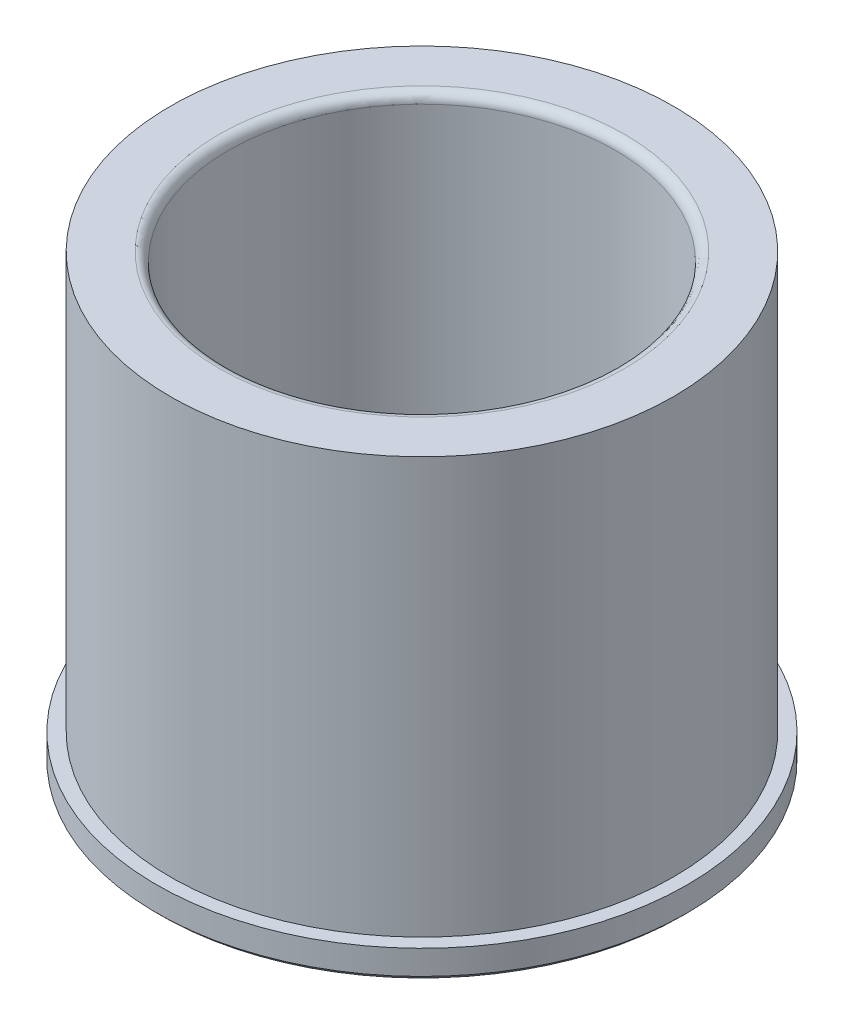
ISO-10303-21;
HEADER;
FILE_DESCRIPTION(('STEP AP214'),'2;1');
FILE_NAME('part.step','',(''),(''),'','','');
FILE_SCHEMA(('AUTOMOTIVE_DESIGN { 1 0 10303 214 1 1 1 1 }'));
ENDSEC;
DATA;
#1=APPLICATION_CONTEXT('core data for automotive mechanical design processes');
#2=APPLICATION_PROTOCOL_DEFINITION('international standard','automotive_design',2000,#1);
#3=PRODUCT_CONTEXT('',#1,'mechanical');
#4=PRODUCT('Part','Part','',(#3));
#5=PRODUCT_RELATED_PRODUCT_CATEGORY('part','',(#4));
#6=PRODUCT_DEFINITION_FORMATION('','',#4);
#7=PRODUCT_DEFINITION_CONTEXT('part definition',#1,'design');
#8=PRODUCT_DEFINITION('design','',#6,#7);
#9=PRODUCT_DEFINITION_SHAPE('','',#8);
#10=(LENGTH_UNIT() NAMED_UNIT(*) SI_UNIT(.MILLI.,.METRE.));
#11=(NAMED_UNIT(*) PLANE_ANGLE_UNIT() SI_UNIT($,.RADIAN.));
#12=(NAMED_UNIT(*) SI_UNIT($,.STERADIAN.) SOLID_ANGLE_UNIT());
#13=UNCERTAINTY_MEASURE_WITH_UNIT(LENGTH_MEASURE(1.E-05),#10,'distance_accuracy_value','');
#14=(GEOMETRIC_REPRESENTATION_CONTEXT(3) GLOBAL_UNCERTAINTY_ASSIGNED_CONTEXT((#13)) GLOBAL_UNIT_ASSIGNED_CONTEXT((#10,
#11,#12)) REPRESENTATION_CONTEXT('',''));
#15=CARTESIAN_POINT('',(0.,0.,0.));
#16=DIRECTION('',(0.,0.,1.));
#17=DIRECTION('',(1.,0.,0.));
#18=AXIS2_PLACEMENT_3D('',#15,#16,#17);
#19=CARTESIAN_POINT('',(3.49148336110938E-12,-1000.,0.));
#20=DIRECTION('',(0.,-1.,0.));
#21=DIRECTION('',(1.,0.,0.));
#22=AXIS2_PLACEMENT_3D('',#19,#20,#21);
#23=CYLINDRICAL_SURFACE('',#22,41.2813499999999);
#24=CARTESIAN_POINT('',(0.,4.76250000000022,0.));
#25=DIRECTION('',(0.,-1.,0.));
#26=DIRECTION('',(1.,0.,0.));
#27=AXIS2_PLACEMENT_3D('',#24,#25,#26);
#28=CIRCLE('',#27,41.28135);
#29=CARTESIAN_POINT('',(41.2813499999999,4.76250000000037,0.));
#30=VERTEX_POINT('',#29);
#31=EDGE_CURVE('E60',#30,#30,#28,.T.);
#32=ORIENTED_EDGE('',*,*,#31,.F.);
#33=EDGE_LOOP('',(#32));
#34=FACE_BOUND('',#33,.T.);
#35=CARTESIAN_POINT('',(-2.54965572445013E-13,73.0250000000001,0.));
#36=DIRECTION('',(0.,-1.,0.));
#37=DIRECTION('',(1.,0.,0.));
#38=AXIS2_PLACEMENT_3D('',#35,#36,#37);
#39=CIRCLE('',#38,41.2813499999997);
#40=CARTESIAN_POINT('',(41.2813499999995,73.0250000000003,0.));
#41=VERTEX_POINT('',#40);
#42=EDGE_CURVE('E39',#41,#41,#39,.T.);
#43=ORIENTED_EDGE('',*,*,#42,.T.);
#44=EDGE_LOOP('',(#43));
#45=FACE_BOUND('',#44,.T.);
#46=ADVANCED_FACE('F28',(#34,#45),#23,.T.);
#47=CARTESIAN_POINT('',(-41.28135,73.025,0.));
#48=DIRECTION('',(0.,-1.,0.));
#49=DIRECTION('',(1.,0.,0.));
#50=AXIS2_PLACEMENT_3D('',#47,#48,#49);
#51=PLANE('',#50);
#52=CARTESIAN_POINT('',(-2.54965572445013E-13,73.0250000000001,0.));
#53=DIRECTION('',(0.,-1.,0.));
#54=DIRECTION('',(1.,0.,0.));
#55=AXIS2_PLACEMENT_3D('',#52,#53,#54);
#56=CIRCLE('',#55,33.2803499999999);
#57=CARTESIAN_POINT('',(33.2803499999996,73.0250000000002,0.));
#58=VERTEX_POINT('',#57);
#59=EDGE_CURVE('E35',#58,#58,#56,.T.);
#60=ORIENTED_EDGE('',*,*,#59,.T.);
#61=EDGE_LOOP('',(#60));
#62=FACE_BOUND('',#61,.T.);
#63=ORIENTED_EDGE('',*,*,#42,.F.);
#64=EDGE_LOOP('',(#63));
#65=FACE_BOUND('',#64,.T.);
#66=ADVANCED_FACE('F68',(#62,#65),#51,.F.);
#67=CARTESIAN_POINT('',(3.49148336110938E-12,-1000.,0.));
#68=DIRECTION('',(0.,-1.,0.));
#69=DIRECTION('',(1.,0.,0.));
#70=AXIS2_PLACEMENT_3D('',#67,#68,#69);
#71=CYLINDRICAL_SURFACE('',#70,31.7563499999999);
#72=CARTESIAN_POINT('',(-2.49644551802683E-13,71.5010000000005,0.));
#73=DIRECTION('',(0.,-1.,0.));
#74=DIRECTION('',(1.,0.,0.));
#75=AXIS2_PLACEMENT_3D('',#72,#73,#74);
#76=CIRCLE('',#75,31.7563499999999);
#77=CARTESIAN_POINT('',(31.7563499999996,71.5010000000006,0.));
#78=VERTEX_POINT('',#77);
#79=EDGE_CURVE('E10',#78,#78,#76,.F.);
#80=ORIENTED_EDGE('',*,*,#79,.T.);
#81=EDGE_LOOP('',(#80));
#82=FACE_BOUND('',#81,.T.);
#83=CARTESIAN_POINT('',(0.,0.761999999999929,0.));
#84=DIRECTION('',(0.,-1.,0.));
#85=DIRECTION('',(1.,0.,0.));
#86=AXIS2_PLACEMENT_3D('',#83,#84,#85);
#87=CIRCLE('',#86,31.75635);
#88=CARTESIAN_POINT('',(31.75635,0.76200000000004,0.));
#89=VERTEX_POINT('',#88);
#90=EDGE_CURVE('E43',#89,#89,#87,.T.);
#91=ORIENTED_EDGE('',*,*,#90,.T.);
#92=EDGE_LOOP('',(#91));
#93=FACE_BOUND('',#92,.T.);
#94=ADVANCED_FACE('F72',(#82,#93),#71,.F.);
#95=CARTESIAN_POINT('',(0.,2.22044604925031E-13,0.));
#96=DIRECTION('',(0.,-1.,0.));
#97=DIRECTION('',(1.,0.,0.));
#98=AXIS2_PLACEMENT_3D('',#95,#96,#97);
#99=CONICAL_SURFACE('',#98,32.51835,0.78539816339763);
#100=ORIENTED_EDGE('',*,*,#90,.F.);
#101=EDGE_LOOP('',(#100));
#102=FACE_BOUND('',#101,.T.);
#103=CARTESIAN_POINT('',(0.,2.22044604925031E-13,0.));
#104=DIRECTION('',(0.,-1.,0.));
#105=DIRECTION('',(1.,0.,0.));
#106=AXIS2_PLACEMENT_3D('',#103,#104,#105);
#107=CIRCLE('',#106,32.51835);
#108=CARTESIAN_POINT('',(32.51835,3.35581882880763E-13,0.));
#109=VERTEX_POINT('',#108);
#110=EDGE_CURVE('E48',#109,#109,#107,.T.);
#111=ORIENTED_EDGE('',*,*,#110,.T.);
#112=EDGE_LOOP('',(#111));
#113=FACE_BOUND('',#112,.T.);
#114=ADVANCED_FACE('F77',(#102,#113),#99,.F.);
#115=CARTESIAN_POINT('',(-32.51835,0.,0.));
#116=DIRECTION('',(0.,1.,0.));
#117=DIRECTION('',(-1.,0.,0.));
#118=AXIS2_PLACEMENT_3D('',#115,#116,#117);
#119=PLANE('',#118);
#120=ORIENTED_EDGE('',*,*,#110,.F.);
#121=EDGE_LOOP('',(#120));
#122=FACE_BOUND('',#121,.T.);
#123=CARTESIAN_POINT('',(0.,2.22044604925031E-13,0.));
#124=DIRECTION('',(0.,-1.,0.));
#125=DIRECTION('',(1.,0.,0.));
#126=AXIS2_PLACEMENT_3D('',#123,#124,#125);
#127=CIRCLE('',#126,42.7609);
#128=CARTESIAN_POINT('',(42.7609,3.71343575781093E-13,0.));
#129=VERTEX_POINT('',#128);
#130=EDGE_CURVE('E51',#129,#129,#127,.T.);
#131=ORIENTED_EDGE('',*,*,#130,.T.);
#132=EDGE_LOOP('',(#131));
#133=FACE_BOUND('',#132,.T.);
#134=ADVANCED_FACE('F82',(#122,#133),#119,.F.);
#135=CARTESIAN_POINT('',(0.,0.762000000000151,0.));
#136=DIRECTION('',(0.,1.,0.));
#137=DIRECTION('',(-1.,0.,0.));
#138=AXIS2_PLACEMENT_3D('',#135,#136,#137);
#139=CONICAL_SURFACE('',#138,43.5229,0.785398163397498);
#140=ORIENTED_EDGE('',*,*,#130,.F.);
#141=EDGE_LOOP('',(#140));
#142=FACE_BOUND('',#141,.T.);
#143=CARTESIAN_POINT('',(0.,0.762000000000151,0.));
#144=DIRECTION('',(0.,-1.,0.));
#145=DIRECTION('',(1.,0.,0.));
#146=AXIS2_PLACEMENT_3D('',#143,#144,#145);
#147=CIRCLE('',#146,43.5229);
#148=CARTESIAN_POINT('',(43.5229,0.762000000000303,0.));
#149=VERTEX_POINT('',#148);
#150=EDGE_CURVE('E54',#149,#149,#147,.T.);
#151=ORIENTED_EDGE('',*,*,#150,.T.);
#152=EDGE_LOOP('',(#151));
#153=FACE_BOUND('',#152,.T.);
#154=ADVANCED_FACE('F86',(#142,#153),#139,.T.);
#155=CARTESIAN_POINT('',(3.49148336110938E-12,-1000.,0.));
#156=DIRECTION('',(0.,-1.,0.));
#157=DIRECTION('',(1.,0.,0.));
#158=AXIS2_PLACEMENT_3D('',#155,#156,#157);
#159=CYLINDRICAL_SURFACE('',#158,43.5229);
#160=ORIENTED_EDGE('',*,*,#150,.F.);
#161=EDGE_LOOP('',(#160));
#162=FACE_BOUND('',#161,.T.);
#163=CARTESIAN_POINT('',(0.,4.76250000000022,0.));
#164=DIRECTION('',(0.,-1.,0.));
#165=DIRECTION('',(1.,0.,0.));
#166=AXIS2_PLACEMENT_3D('',#163,#164,#165);
#167=CIRCLE('',#166,43.5229);
#168=CARTESIAN_POINT('',(43.5229,4.76250000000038,0.));
#169=VERTEX_POINT('',#168);
#170=EDGE_CURVE('E57',#169,#169,#167,.T.);
#171=ORIENTED_EDGE('',*,*,#170,.T.);
#172=EDGE_LOOP('',(#171));
#173=FACE_BOUND('',#172,.T.);
#174=ADVANCED_FACE('F90',(#162,#173),#159,.T.);
#175=CARTESIAN_POINT('',(-43.5229,4.76249999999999,0.));
#176=DIRECTION('',(0.,-1.,0.));
#177=DIRECTION('',(1.,0.,0.));
#178=AXIS2_PLACEMENT_3D('',#175,#176,#177);
#179=PLANE('',#178);
#180=ORIENTED_EDGE('',*,*,#170,.F.);
#181=EDGE_LOOP('',(#180));
#182=FACE_BOUND('',#181,.T.);
#183=ORIENTED_EDGE('',*,*,#31,.T.);
#184=EDGE_LOOP('',(#183));
#185=FACE_BOUND('',#184,.T.);
#186=ADVANCED_FACE('F64',(#182,#185),#179,.F.);
#187=CARTESIAN_POINT('',(-2.49644551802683E-13,71.5010000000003,0.));
#188=DIRECTION('',(0.,-1.,0.));
#189=DIRECTION('',(1.,0.,0.));
#190=AXIS2_PLACEMENT_3D('',#187,#188,#189);
#191=TOROIDAL_SURFACE('',#190,33.2803499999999,1.524);
#192=ORIENTED_EDGE('',*,*,#79,.F.);
#193=EDGE_LOOP('',(#192));
#194=FACE_BOUND('',#193,.T.);
#195=ORIENTED_EDGE('',*,*,#59,.F.);
#196=EDGE_LOOP('',(#195));
#197=FACE_BOUND('',#196,.T.);
#198=ADVANCED_FACE('F30',(#194,#197),#191,.T.);
#199=CLOSED_SHELL('',(#46,#66,#94,#114,#134,#154,#174,#186,#198));
#200=MANIFOLD_SOLID_BREP('B2',#199);
#201=ADVANCED_BREP_SHAPE_REPRESENTATION('',(#18,#200),#14);
#202=SHAPE_DEFINITION_REPRESENTATION(#9,#201);
ENDSEC;
END-ISO-10303-21;
